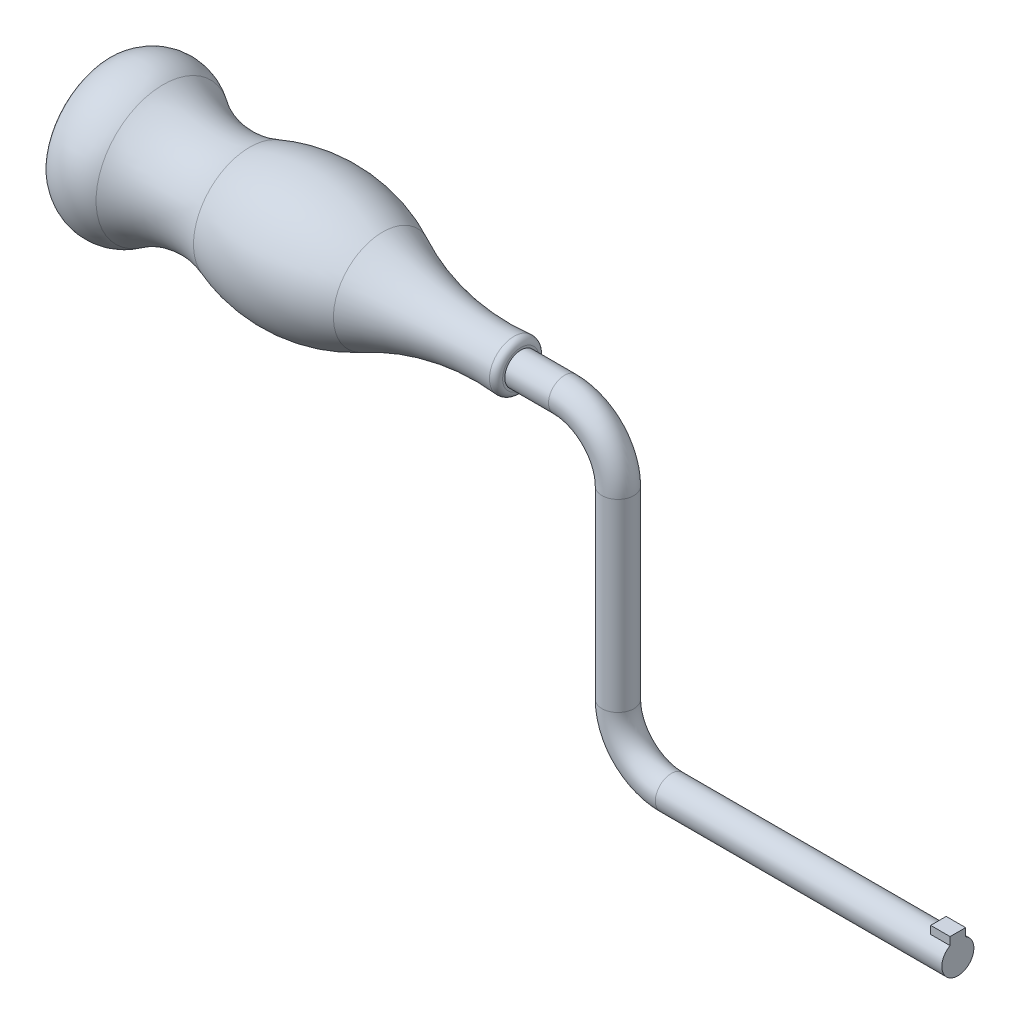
from build123d import *

# Parameters (mm, degrees)
SKETCH2_R      = 2.0955
EXTRUDE1_DEPTH = 1.016


with BuildPart() as part:
    # Sweep1: sweep along a path in Sketch1
    with BuildLine(Plane.XY) as sweep1_path:
        Line((13.335, 313.435579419), (-24.13, 313.435579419))
        ThreePointArc((-24.13, 313.435579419), (-29.069140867, 315.481438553), (-31.115, 320.420579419))
        Line((-31.115, 320.420579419), (-31.115, 344.550579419))
        ThreePointArc((-31.115, 344.550579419), (-33.160859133, 349.489720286), (-38.1, 351.535579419))
        Line((-38.1, 351.535579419), (-43.815, 351.535579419))
    # Sketch2 → Sweep1 (sweep)
    with BuildSketch(Plane(origin=(-43.815, 351.535579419, 0), x_dir=(0, 0, 1), z_dir=(-1, 0, 0))):
        Circle(SKETCH2_R)
    sweep(path=sweep1_path.line)

    # Sketch4 → Extrude1 (add, symmetric)
    with BuildSketch(Plane.XY):
        Polygon((13.335, 315.531079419), (13.335, 316.293079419), (10.795, 316.293079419), (10.795, 315.531079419), (10.795, 315.150079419), (13.335, 315.150079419), align=None)
    extrude(amount=EXTRUDE1_DEPTH, both=True)

    # Sketch3 → Revolve1 (revolve)
    with BuildSketch(Plane.XY, mode=Mode.PRIVATE) as revolve1_sk:
        with BuildLine():
            Line((-43.815, 351.535579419), (-43.815, 353.91621831))
            ThreePointArc((-43.815, 353.91621831), (-44.082508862, 354.524573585), (-44.711659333, 354.738645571))
            ThreePointArc((-44.711659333, 354.738645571), (-53.518008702, 355.179771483), (-61.880081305, 357.976577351))
            ThreePointArc((-61.880081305, 357.976577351), (-70.480778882, 360.224875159), (-79.269074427, 358.885956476))
            ThreePointArc((-79.269074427, 358.885956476), (-85.101187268, 358.215398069), (-90.583244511, 360.315454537))
            ThreePointArc((-90.583244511, 360.315454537), (-94.017534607, 361.320765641), (-97.369492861, 360.06801876))
            ThreePointArc((-97.369492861, 360.06801876), (-97.595908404, 359.781608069), (-97.676644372, 359.42555079))
            Line((-97.676644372, 359.42555079), (-97.676644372, 351.535579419))
            Line((-97.676644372, 351.535579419), (-43.815, 351.535579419))
        make_face()
    revolve(revolve1_sk.sketch.rotate(Axis((-38.1, 351.535579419, 0), (-1, 0, 0)), 90), axis=Axis((-38.1, 351.535579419, 0), (-1, 0, 0)))


solid = part.part
